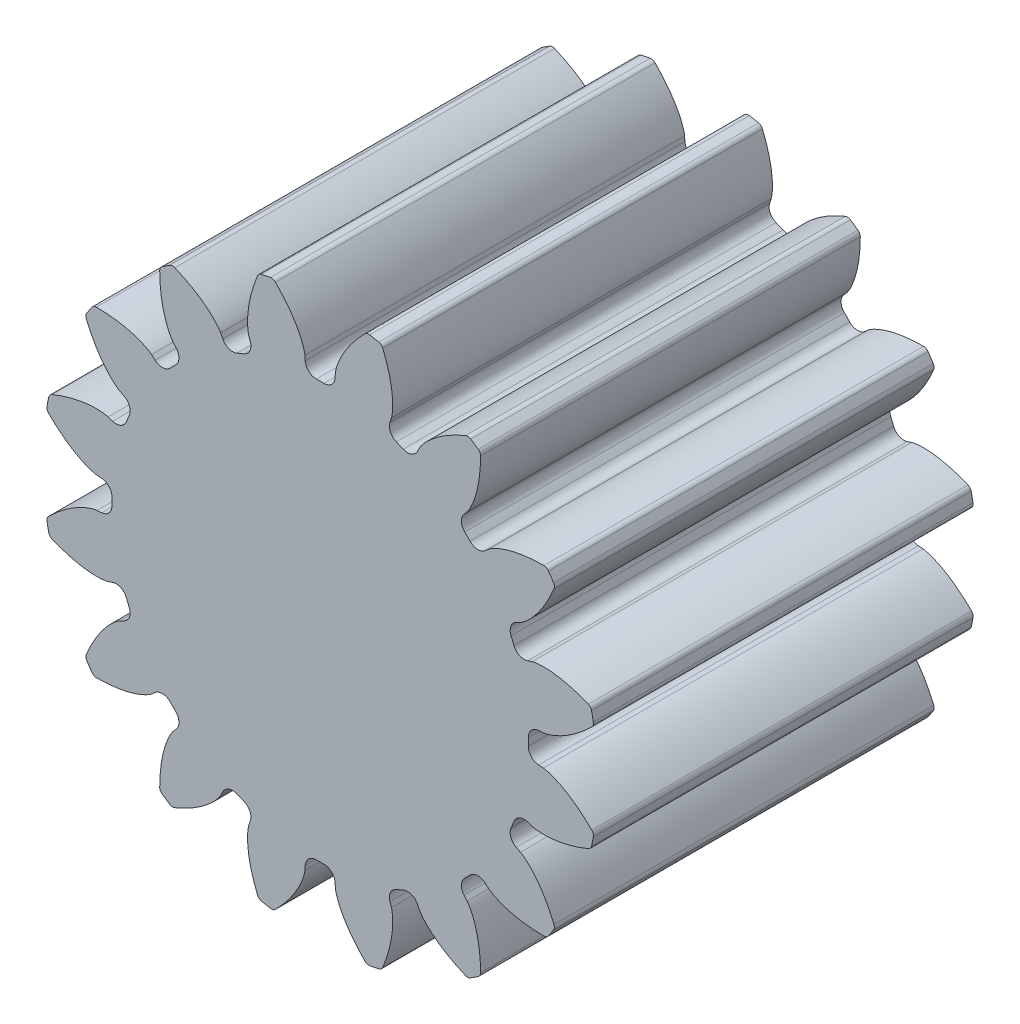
from build123d import *

# Parameters (mm, degrees)
SKETCH1_R                                 = 9.286875
BOSS_EXTRUDE1_DEPTH                       = 12.7
CUT_EXTRUDE_DCLTBC_DEPTH                  = 19.269704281
FILLET_TIP_DCLTBC_R                       = 0.183495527
FILLET_ROOT_DCLTBC_R                      = 0.366991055
CIRPATTERN_DCLTBC_COUNT                   = 16
FILLET_TIP_DCLTBC_OF_CIRPATTERN_DCLTBC_R  = 0.183495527
FILLET_ROOT_DCLTBC_OF_CIRPATTERN_DCLTBC_R = 0.366991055


with BuildPart() as part:
    # Sketch1 → Boss-Extrude1 (new body)
    with BuildSketch(Plane.XY):
        Circle(SKETCH1_R)
    extrude(amount=BOSS_EXTRUDE1_DEPTH)

    # DCLTBC → Cut-Extrude-DCLTBC (cut, through all)
    with BuildSketch(Plane.XY):
        with BuildLine():
            Line((-0.509843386, 7.464178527), (-0.474651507, 6.948964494))
            ThreePointArc((-0.474651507, 6.948964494), (0, 6.96515625), (0.474651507, 6.948964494))
            Line((0.474651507, 6.948964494), (0.509843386, 7.464178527))
            add(Edge.make_bspline(
                [(0.509843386, 7.464178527), (0.510093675, 7.467159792), (0.510939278, 7.47550893), (0.513104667, 7.49123989), (0.517440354, 7.51680925), (0.524141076, 7.549224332), (0.534147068, 7.590898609), (0.547657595, 7.639673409), (0.5643017, 7.692901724), (0.584337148, 7.750366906), (0.606020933, 7.807271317), (0.62921983, 7.863610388), (0.653738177, 7.919329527), (0.685090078, 7.986314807), (0.724974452, 8.065909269), (0.774894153, 8.157800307), (0.835380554, 8.260606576), (0.90110569, 8.363759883), (0.969114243, 8.463891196), (1.041598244, 8.563376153), (1.114399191, 8.658431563), (1.193796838, 8.755311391), (1.269015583, 8.843802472), (1.357387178, 8.940775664), (1.42990912, 9.018410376), (1.508183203, 9.096721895), (1.546772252, 9.13455481), (1.566699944, 9.153769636)],
                knots=[0, 0, 0, 0, 0, 0.005376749, 0.015083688, 0.02853182, 0.046610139, 0.064854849, 0.092110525, 0.119476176, 0.146842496, 0.174208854, 0.201574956, 0.228941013, 0.256307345, 0.307035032, 0.361767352, 0.416499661, 0.471231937, 0.525964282, 0.580696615, 0.635428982, 0.690161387, 0.744893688, 0.799626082, 0.854358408, 0.909090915, 0.909090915, 0.909090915, 0.909090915, 0.909090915], degree=4))
            ThreePointArc((1.566699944, 9.153769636), (0, 9.286875), (-1.566699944, 9.153769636))
            add(Edge.make_bspline(
                [(-0.509843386, 7.464178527), (-0.510093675, 7.467159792), (-0.510939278, 7.47550893), (-0.513104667, 7.49123989), (-0.517440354, 7.51680925), (-0.524141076, 7.549224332), (-0.534147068, 7.590898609), (-0.547657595, 7.639673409), (-0.5643017, 7.692901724), (-0.584337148, 7.750366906), (-0.606020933, 7.807271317), (-0.62921983, 7.863610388), (-0.653738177, 7.919329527), (-0.685090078, 7.986314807), (-0.724974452, 8.065909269), (-0.774894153, 8.157800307), (-0.835380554, 8.260606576), (-0.90110569, 8.363759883), (-0.969114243, 8.463891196), (-1.041598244, 8.563376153), (-1.114399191, 8.658431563), (-1.193796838, 8.755311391), (-1.269015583, 8.843802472), (-1.357387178, 8.940775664), (-1.42990912, 9.018410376), (-1.508183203, 9.096721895), (-1.546772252, 9.13455481), (-1.566699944, 9.153769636)],
                knots=[0, 0, 0, 0, 0, 0.005376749, 0.015083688, 0.02853182, 0.046610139, 0.064854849, 0.092110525, 0.119476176, 0.146842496, 0.174208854, 0.201574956, 0.228941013, 0.256307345, 0.307035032, 0.361767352, 0.416499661, 0.471231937, 0.525964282, 0.580696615, 0.635428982, 0.690161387, 0.744893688, 0.799626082, 0.854358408, 0.909090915, 0.909090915, 0.909090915, 0.909090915, 0.909090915], degree=4))
        make_face()
    cut_extrude_dcltbc = extrude(amount=CUT_EXTRUDE_DCLTBC_DEPTH, mode=Mode.SUBTRACT)

    # Fillet-Tip-DCLTBC
    fillet_tip_dcltbc_edges = [part.edges().sort_by_distance(p)[0] for p in [
        (1.566699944, 9.153769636, 6.35),
        (-1.566699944, 9.153769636, 6.35),
    ]]
    fillet(fillet_tip_dcltbc_edges, radius=FILLET_TIP_DCLTBC_R)

    # Fillet-Root-DCLTBC
    fillet_root_dcltbc_edges = [part.edges().sort_by_distance(p)[0] for p in [
        (0.474651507, 6.948964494, 6.35),
        (-0.474651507, 6.948964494, 6.35),
    ]]
    fillet(fillet_root_dcltbc_edges, radius=FILLET_ROOT_DCLTBC_R)

    # CirPattern-DCLTBC: Cut-Extrude-DCLTBC ×16 about axis
    cirpattern_dcltbc_axis = Axis((0, 0, 12.7), (0, 0, 1))
    for i in range(1, CIRPATTERN_DCLTBC_COUNT):
        add(cut_extrude_dcltbc.rotate(cirpattern_dcltbc_axis, i * 360 / CIRPATTERN_DCLTBC_COUNT), mode=Mode.SUBTRACT)

    # Fillet-Tip-DCLTBC of CirPattern-DCLTBC
    fillet_tip_dcltbc_of_cirpattern_dcltbc_edges = [part.edges().sort_by_distance(p)[0] for p in [
        (-2.055553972, 9.056530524, 6.35),
        (-4.950437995, 7.8574303, 6.35),
        (-5.364868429, 7.580516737, 6.35),
        (-7.580516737, 5.364868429, 6.35),
        (-7.8574303, 4.950437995, 6.35),
        (-9.056530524, 2.055553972, 6.35),
        (-9.153769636, 1.566699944, 6.35),
        (-9.153769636, -1.566699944, 6.35),
        (-9.056530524, -2.055553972, 6.35),
        (-7.8574303, -4.950437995, 6.35),
        (-7.580516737, -5.364868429, 6.35),
        (-5.364868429, -7.580516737, 6.35),
        (-4.950437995, -7.8574303, 6.35),
        (-2.055553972, -9.056530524, 6.35),
        (-1.566699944, -9.153769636, 6.35),
        (1.566699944, -9.153769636, 6.35),
        (2.055553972, -9.056530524, 6.35),
        (4.950437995, -7.8574303, 6.35),
        (5.364868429, -7.580516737, 6.35),
        (7.580516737, -5.364868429, 6.35),
        (7.8574303, -4.950437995, 6.35),
        (9.056530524, -2.055553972, 6.35),
        (9.153769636, -1.566699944, 6.35),
        (9.153769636, 1.566699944, 6.35),
        (9.056530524, 2.055553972, 6.35),
        (7.8574303, 4.950437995, 6.35),
        (7.580516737, 5.364868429, 6.35),
        (5.364868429, 7.580516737, 6.35),
        (4.950437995, 7.8574303, 6.35),
        (2.055553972, 9.056530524, 6.35),
    ]]
    fillet(fillet_tip_dcltbc_of_cirpattern_dcltbc_edges, radius=FILLET_TIP_DCLTBC_OF_CIRPATTERN_DCLTBC_R)

    # Fillet-Root-DCLTBC of CirPattern-DCLTBC
    fillet_root_dcltbc_of_cirpattern_dcltbc_edges = [part.edges().sort_by_distance(p)[0] for p in [
        (-2.220732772, 6.601647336, 6.35),
        (-3.097774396, 6.2383648, 6.35),
        (-4.578030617, 5.249289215, 6.35),
        (-5.249289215, 4.578030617, 6.35),
        (-6.2383648, 3.097774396, 6.35),
        (-6.601647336, 2.220732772, 6.35),
        (-6.948964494, 0.474651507, 6.35),
        (-6.948964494, -0.474651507, 6.35),
        (-6.601647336, -2.220732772, 6.35),
        (-6.2383648, -3.097774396, 6.35),
        (-5.249289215, -4.578030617, 6.35),
        (-4.578030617, -5.249289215, 6.35),
        (-3.097774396, -6.2383648, 6.35),
        (-2.220732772, -6.601647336, 6.35),
        (-0.474651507, -6.948964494, 6.35),
        (0.474651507, -6.948964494, 6.35),
        (2.220732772, -6.601647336, 6.35),
        (3.097774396, -6.2383648, 6.35),
        (4.578030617, -5.249289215, 6.35),
        (5.249289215, -4.578030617, 6.35),
        (6.2383648, -3.097774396, 6.35),
        (6.601647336, -2.220732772, 6.35),
        (6.948964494, -0.474651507, 6.35),
        (6.948964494, 0.474651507, 6.35),
        (6.601647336, 2.220732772, 6.35),
        (6.2383648, 3.097774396, 6.35),
        (5.249289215, 4.578030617, 6.35),
        (4.578030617, 5.249289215, 6.35),
        (3.097774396, 6.2383648, 6.35),
        (2.220732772, 6.601647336, 6.35),
    ]]
    fillet(fillet_root_dcltbc_of_cirpattern_dcltbc_edges, radius=FILLET_ROOT_DCLTBC_OF_CIRPATTERN_DCLTBC_R)


solid = part.part
